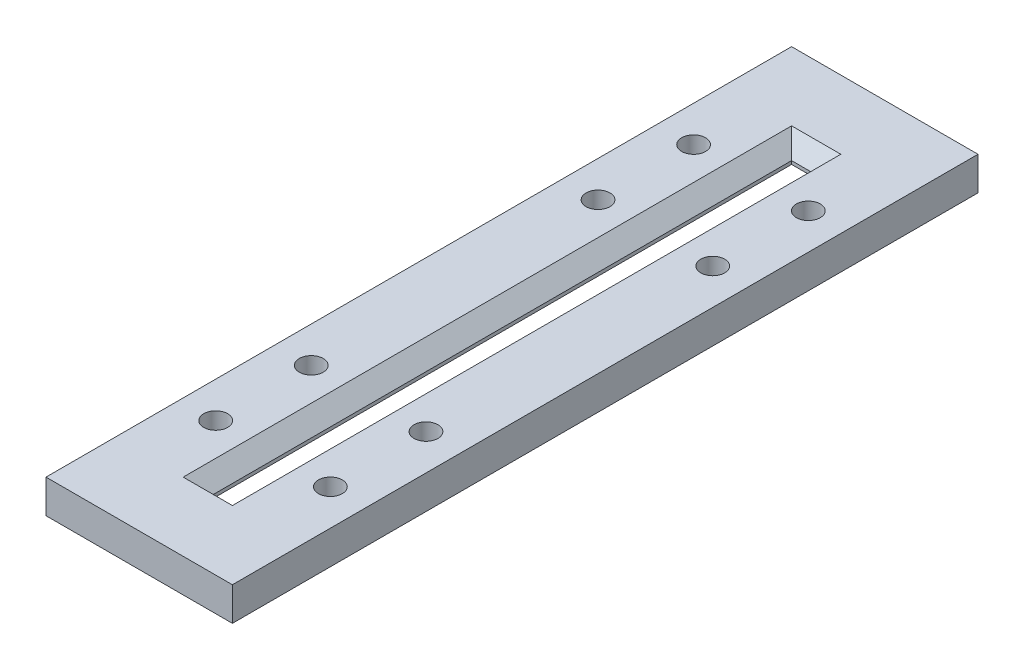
ISO-10303-21;
HEADER;
FILE_DESCRIPTION(('STEP AP214'),'2;1');
FILE_NAME('part.step','',(''),(''),'','','');
FILE_SCHEMA(('AUTOMOTIVE_DESIGN { 1 0 10303 214 1 1 1 1 }'));
ENDSEC;
DATA;
#1=APPLICATION_CONTEXT('core data for automotive mechanical design processes');
#2=APPLICATION_PROTOCOL_DEFINITION('international standard','automotive_design',2000,#1);
#3=PRODUCT_CONTEXT('',#1,'mechanical');
#4=PRODUCT('Part','Part','',(#3));
#5=PRODUCT_RELATED_PRODUCT_CATEGORY('part','',(#4));
#6=PRODUCT_DEFINITION_FORMATION('','',#4);
#7=PRODUCT_DEFINITION_CONTEXT('part definition',#1,'design');
#8=PRODUCT_DEFINITION('design','',#6,#7);
#9=PRODUCT_DEFINITION_SHAPE('','',#8);
#10=(LENGTH_UNIT() NAMED_UNIT(*) SI_UNIT(.MILLI.,.METRE.));
#11=(NAMED_UNIT(*) PLANE_ANGLE_UNIT() SI_UNIT($,.RADIAN.));
#12=(NAMED_UNIT(*) SI_UNIT($,.STERADIAN.) SOLID_ANGLE_UNIT());
#13=UNCERTAINTY_MEASURE_WITH_UNIT(LENGTH_MEASURE(1.E-05),#10,'distance_accuracy_value','');
#14=(GEOMETRIC_REPRESENTATION_CONTEXT(3) GLOBAL_UNCERTAINTY_ASSIGNED_CONTEXT((#13)) GLOBAL_UNIT_ASSIGNED_CONTEXT((#10,
#11,#12)) REPRESENTATION_CONTEXT('',''));
#15=CARTESIAN_POINT('',(0.,0.,0.));
#16=DIRECTION('',(0.,0.,1.));
#17=DIRECTION('',(1.,0.,0.));
#18=AXIS2_PLACEMENT_3D('',#15,#16,#17);
#19=CARTESIAN_POINT('',(0.,44.45,0.));
#20=DIRECTION('',(0.,1.,0.));
#21=DIRECTION('',(0.,0.,1.));
#22=AXIS2_PLACEMENT_3D('',#19,#20,#21);
#23=PLANE('',#22);
#24=DIRECTION('',(0.,0.,-1.));
#25=VECTOR('',#24,1.);
#26=CARTESIAN_POINT('',(-32.7,44.45,0.));
#27=LINE('',#26,#25);
#28=CARTESIAN_POINT('',(-32.7,44.45,404.174999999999));
#29=VERTEX_POINT('',#28);
#30=CARTESIAN_POINT('',(-32.7000000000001,44.45,-404.175000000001));
#31=VERTEX_POINT('',#30);
#32=EDGE_CURVE('E211',#29,#31,#27,.T.);
#33=ORIENTED_EDGE('',*,*,#32,.T.);
#34=DIRECTION('',(1.,0.,0.));
#35=VECTOR('',#34,1.);
#36=CARTESIAN_POINT('',(0.,44.45,-404.175000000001));
#37=LINE('',#36,#35);
#38=CARTESIAN_POINT('',(32.7,44.45,-404.175000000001));
#39=VERTEX_POINT('',#38);
#40=EDGE_CURVE('E11',#31,#39,#37,.T.);
#41=ORIENTED_EDGE('',*,*,#40,.T.);
#42=DIRECTION('',(0.,0.,1.));
#43=VECTOR('',#42,1.);
#44=CARTESIAN_POINT('',(32.7,44.45,0.));
#45=LINE('',#44,#43);
#46=CARTESIAN_POINT('',(32.7000000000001,44.45,404.174999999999));
#47=VERTEX_POINT('',#46);
#48=EDGE_CURVE('E60',#39,#47,#45,.T.);
#49=ORIENTED_EDGE('',*,*,#48,.T.);
#50=DIRECTION('',(-1.,0.,0.));
#51=VECTOR('',#50,1.);
#52=CARTESIAN_POINT('',(0.,44.45,404.174999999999));
#53=LINE('',#52,#51);
#54=EDGE_CURVE('E212',#47,#29,#53,.T.);
#55=ORIENTED_EDGE('',*,*,#54,.T.);
#56=EDGE_LOOP('',(#33,#41,#49,#55));
#57=FACE_BOUND('',#56,.T.);
#58=CARTESIAN_POINT('',(-76.1999999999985,44.45,317.499999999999));
#59=DIRECTION('',(0.,1.,0.));
#60=DIRECTION('',(0.,0.,1.));
#61=AXIS2_PLACEMENT_3D('',#58,#59,#60);
#62=CIRCLE('',#61,15.8749999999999);
#63=CARTESIAN_POINT('',(-76.1999999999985,44.45,333.374999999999));
#64=VERTEX_POINT('',#63);
#65=EDGE_CURVE('E412',#64,#64,#62,.T.);
#66=ORIENTED_EDGE('',*,*,#65,.F.);
#67=EDGE_LOOP('',(#66));
#68=FACE_BOUND('',#67,.T.);
#69=CARTESIAN_POINT('',(-76.1999999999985,44.45,-317.500000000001));
#70=DIRECTION('',(0.,1.,0.));
#71=DIRECTION('',(0.,0.,1.));
#72=AXIS2_PLACEMENT_3D('',#69,#70,#71);
#73=CIRCLE('',#72,15.875);
#74=CARTESIAN_POINT('',(-76.1999999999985,44.45,-301.625000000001));
#75=VERTEX_POINT('',#74);
#76=EDGE_CURVE('E419',#75,#75,#73,.T.);
#77=ORIENTED_EDGE('',*,*,#76,.F.);
#78=EDGE_LOOP('',(#77));
#79=FACE_BOUND('',#78,.T.);
#80=CARTESIAN_POINT('',(76.2000000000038,44.45,-317.500000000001));
#81=DIRECTION('',(0.,1.,0.));
#82=DIRECTION('',(0.,0.,1.));
#83=AXIS2_PLACEMENT_3D('',#80,#81,#82);
#84=CIRCLE('',#83,15.875);
#85=CARTESIAN_POINT('',(76.2000000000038,44.45,-301.625000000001));
#86=VERTEX_POINT('',#85);
#87=EDGE_CURVE('E428',#86,#86,#84,.T.);
#88=ORIENTED_EDGE('',*,*,#87,.F.);
#89=EDGE_LOOP('',(#88));
#90=FACE_BOUND('',#89,.T.);
#91=CARTESIAN_POINT('',(76.2000000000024,44.45,190.499999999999));
#92=DIRECTION('',(0.,1.,0.));
#93=DIRECTION('',(0.,0.,1.));
#94=AXIS2_PLACEMENT_3D('',#91,#92,#93);
#95=CIRCLE('',#94,15.875);
#96=CARTESIAN_POINT('',(76.2000000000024,44.45,206.374999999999));
#97=VERTEX_POINT('',#96);
#98=EDGE_CURVE('E382',#97,#97,#95,.T.);
#99=ORIENTED_EDGE('',*,*,#98,.F.);
#100=EDGE_LOOP('',(#99));
#101=FACE_BOUND('',#100,.T.);
#102=CARTESIAN_POINT('',(-76.1999999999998,44.45,190.499999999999));
#103=DIRECTION('',(0.,1.,0.));
#104=DIRECTION('',(0.,0.,1.));
#105=AXIS2_PLACEMENT_3D('',#102,#103,#104);
#106=CIRCLE('',#105,15.8749999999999);
#107=CARTESIAN_POINT('',(-76.1999999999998,44.45,206.374999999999));
#108=VERTEX_POINT('',#107);
#109=EDGE_CURVE('E380',#108,#108,#106,.T.);
#110=ORIENTED_EDGE('',*,*,#109,.F.);
#111=EDGE_LOOP('',(#110));
#112=FACE_BOUND('',#111,.T.);
#113=CARTESIAN_POINT('',(-76.1999999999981,44.45,-190.500000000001));
#114=DIRECTION('',(0.,1.,0.));
#115=DIRECTION('',(0.,0.,1.));
#116=AXIS2_PLACEMENT_3D('',#113,#114,#115);
#117=CIRCLE('',#116,15.875);
#118=CARTESIAN_POINT('',(-76.1999999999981,44.45,-174.625000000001));
#119=VERTEX_POINT('',#118);
#120=EDGE_CURVE('E396',#119,#119,#117,.T.);
#121=ORIENTED_EDGE('',*,*,#120,.F.);
#122=EDGE_LOOP('',(#121));
#123=FACE_BOUND('',#122,.T.);
#124=CARTESIAN_POINT('',(76.2000000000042,44.45,-190.500000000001));
#125=DIRECTION('',(0.,1.,0.));
#126=DIRECTION('',(0.,0.,1.));
#127=AXIS2_PLACEMENT_3D('',#124,#125,#126);
#128=CIRCLE('',#127,15.875);
#129=CARTESIAN_POINT('',(76.2000000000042,44.45,-174.625000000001));
#130=VERTEX_POINT('',#129);
#131=EDGE_CURVE('E234',#130,#130,#128,.T.);
#132=ORIENTED_EDGE('',*,*,#131,.F.);
#133=EDGE_LOOP('',(#132));
#134=FACE_BOUND('',#133,.T.);
#135=CARTESIAN_POINT('',(76.2000000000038,44.45,317.499999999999));
#136=DIRECTION('',(0.,1.,0.));
#137=DIRECTION('',(0.,0.,1.));
#138=AXIS2_PLACEMENT_3D('',#135,#136,#137);
#139=CIRCLE('',#138,15.875);
#140=CARTESIAN_POINT('',(76.2000000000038,44.45,333.374999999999));
#141=VERTEX_POINT('',#140);
#142=EDGE_CURVE('E279',#141,#141,#139,.T.);
#143=ORIENTED_EDGE('',*,*,#142,.F.);
#144=EDGE_LOOP('',(#143));
#145=FACE_BOUND('',#144,.T.);
#146=DIRECTION('',(1.,0.,0.));
#147=VECTOR('',#146,1.);
#148=CARTESIAN_POINT('',(-123.825,44.45,495.299999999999));
#149=LINE('',#148,#147);
#150=CARTESIAN_POINT('',(-123.825,44.45,495.299999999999));
#151=VERTEX_POINT('',#150);
#152=CARTESIAN_POINT('',(123.825,44.45,495.299999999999));
#153=VERTEX_POINT('',#152);
#154=EDGE_CURVE('E151',#151,#153,#149,.T.);
#155=ORIENTED_EDGE('',*,*,#154,.T.);
#156=DIRECTION('',(0.,0.,-1.));
#157=VECTOR('',#156,1.);
#158=CARTESIAN_POINT('',(123.825,44.45,495.299999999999));
#159=LINE('',#158,#157);
#160=CARTESIAN_POINT('',(123.825,44.45,-495.300000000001));
#161=VERTEX_POINT('',#160);
#162=EDGE_CURVE('E138',#153,#161,#159,.T.);
#163=ORIENTED_EDGE('',*,*,#162,.T.);
#164=DIRECTION('',(-1.,0.,0.));
#165=VECTOR('',#164,1.);
#166=CARTESIAN_POINT('',(123.825,44.45,-495.300000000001));
#167=LINE('',#166,#165);
#168=CARTESIAN_POINT('',(-123.825,44.45,-495.300000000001));
#169=VERTEX_POINT('',#168);
#170=EDGE_CURVE('E147',#161,#169,#167,.T.);
#171=ORIENTED_EDGE('',*,*,#170,.T.);
#172=DIRECTION('',(0.,0.,1.));
#173=VECTOR('',#172,1.);
#174=CARTESIAN_POINT('',(-123.825,44.45,-495.300000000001));
#175=LINE('',#174,#173);
#176=EDGE_CURVE('E154',#169,#151,#175,.T.);
#177=ORIENTED_EDGE('',*,*,#176,.T.);
#178=EDGE_LOOP('',(#155,#163,#171,#177));
#179=FACE_BOUND('',#178,.T.);
#180=ADVANCED_FACE('F46',(#57,#68,#79,#90,#101,#112,#123,#134,#145,#179),#23,.T.);
#181=CARTESIAN_POINT('',(0.,0.,0.));
#182=DIRECTION('',(0.,1.,0.));
#183=DIRECTION('',(0.,0.,1.));
#184=AXIS2_PLACEMENT_3D('',#181,#182,#183);
#185=PLANE('',#184);
#186=DIRECTION('',(0.,0.,1.));
#187=VECTOR('',#186,1.);
#188=CARTESIAN_POINT('',(-32.6999999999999,0.,384.174999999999));
#189=LINE('',#188,#187);
#190=CARTESIAN_POINT('',(-32.7,0.,-404.175000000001));
#191=VERTEX_POINT('',#190);
#192=CARTESIAN_POINT('',(-32.6999999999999,0.,404.174999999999));
#193=VERTEX_POINT('',#192);
#194=EDGE_CURVE('E179',#191,#193,#189,.T.);
#195=ORIENTED_EDGE('',*,*,#194,.T.);
#196=DIRECTION('',(1.,0.,0.));
#197=VECTOR('',#196,1.);
#198=CARTESIAN_POINT('',(12.7,0.,404.174999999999));
#199=LINE('',#198,#197);
#200=CARTESIAN_POINT('',(32.6999999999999,0.,404.174999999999));
#201=VERTEX_POINT('',#200);
#202=EDGE_CURVE('E182',#193,#201,#199,.T.);
#203=ORIENTED_EDGE('',*,*,#202,.T.);
#204=DIRECTION('',(0.,0.,-1.));
#205=VECTOR('',#204,1.);
#206=CARTESIAN_POINT('',(32.6999999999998,0.,-384.175000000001));
#207=LINE('',#206,#205);
#208=CARTESIAN_POINT('',(32.6999999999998,0.,-404.175000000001));
#209=VERTEX_POINT('',#208);
#210=EDGE_CURVE('E167',#201,#209,#207,.T.);
#211=ORIENTED_EDGE('',*,*,#210,.T.);
#212=DIRECTION('',(-1.,0.,0.));
#213=VECTOR('',#212,1.);
#214=CARTESIAN_POINT('',(-12.7000000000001,0.,-404.175000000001));
#215=LINE('',#214,#213);
#216=EDGE_CURVE('E168',#209,#191,#215,.T.);
#217=ORIENTED_EDGE('',*,*,#216,.T.);
#218=EDGE_LOOP('',(#195,#203,#211,#217));
#219=FACE_BOUND('',#218,.T.);
#220=CARTESIAN_POINT('',(-76.1999999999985,0.,317.499999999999));
#221=DIRECTION('',(0.,1.,0.));
#222=DIRECTION('',(0.,0.,1.));
#223=AXIS2_PLACEMENT_3D('',#220,#221,#222);
#224=CIRCLE('',#223,15.8749999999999);
#225=CARTESIAN_POINT('',(-76.1999999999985,0.,333.374999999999));
#226=VERTEX_POINT('',#225);
#227=EDGE_CURVE('E409',#226,#226,#224,.T.);
#228=ORIENTED_EDGE('',*,*,#227,.T.);
#229=EDGE_LOOP('',(#228));
#230=FACE_BOUND('',#229,.T.);
#231=CARTESIAN_POINT('',(-76.1999999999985,0.,-317.500000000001));
#232=DIRECTION('',(0.,1.,0.));
#233=DIRECTION('',(0.,0.,1.));
#234=AXIS2_PLACEMENT_3D('',#231,#232,#233);
#235=CIRCLE('',#234,15.875);
#236=CARTESIAN_POINT('',(-76.1999999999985,0.,-301.625000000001));
#237=VERTEX_POINT('',#236);
#238=EDGE_CURVE('E418',#237,#237,#235,.T.);
#239=ORIENTED_EDGE('',*,*,#238,.T.);
#240=EDGE_LOOP('',(#239));
#241=FACE_BOUND('',#240,.T.);
#242=CARTESIAN_POINT('',(76.2000000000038,0.,-317.500000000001));
#243=DIRECTION('',(0.,1.,0.));
#244=DIRECTION('',(0.,0.,1.));
#245=AXIS2_PLACEMENT_3D('',#242,#243,#244);
#246=CIRCLE('',#245,15.875);
#247=CARTESIAN_POINT('',(76.2000000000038,0.,-301.625000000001));
#248=VERTEX_POINT('',#247);
#249=EDGE_CURVE('E424',#248,#248,#246,.T.);
#250=ORIENTED_EDGE('',*,*,#249,.T.);
#251=EDGE_LOOP('',(#250));
#252=FACE_BOUND('',#251,.T.);
#253=CARTESIAN_POINT('',(76.2000000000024,0.,190.499999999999));
#254=DIRECTION('',(0.,1.,0.));
#255=DIRECTION('',(0.,0.,1.));
#256=AXIS2_PLACEMENT_3D('',#253,#254,#255);
#257=CIRCLE('',#256,15.875);
#258=CARTESIAN_POINT('',(76.2000000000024,0.,206.374999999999));
#259=VERTEX_POINT('',#258);
#260=EDGE_CURVE('E389',#259,#259,#257,.T.);
#261=ORIENTED_EDGE('',*,*,#260,.T.);
#262=EDGE_LOOP('',(#261));
#263=FACE_BOUND('',#262,.T.);
#264=CARTESIAN_POINT('',(-76.1999999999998,0.,190.499999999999));
#265=DIRECTION('',(0.,1.,0.));
#266=DIRECTION('',(0.,0.,1.));
#267=AXIS2_PLACEMENT_3D('',#264,#265,#266);
#268=CIRCLE('',#267,15.8749999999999);
#269=CARTESIAN_POINT('',(-76.1999999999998,0.,206.374999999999));
#270=VERTEX_POINT('',#269);
#271=EDGE_CURVE('E379',#270,#270,#268,.T.);
#272=ORIENTED_EDGE('',*,*,#271,.T.);
#273=EDGE_LOOP('',(#272));
#274=FACE_BOUND('',#273,.T.);
#275=CARTESIAN_POINT('',(-76.1999999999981,0.,-190.500000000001));
#276=DIRECTION('',(0.,1.,0.));
#277=DIRECTION('',(0.,0.,1.));
#278=AXIS2_PLACEMENT_3D('',#275,#276,#277);
#279=CIRCLE('',#278,15.875);
#280=CARTESIAN_POINT('',(-76.1999999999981,0.,-174.625000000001));
#281=VERTEX_POINT('',#280);
#282=EDGE_CURVE('E388',#281,#281,#279,.T.);
#283=ORIENTED_EDGE('',*,*,#282,.T.);
#284=EDGE_LOOP('',(#283));
#285=FACE_BOUND('',#284,.T.);
#286=CARTESIAN_POINT('',(76.2000000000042,0.,-190.500000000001));
#287=DIRECTION('',(0.,1.,0.));
#288=DIRECTION('',(0.,0.,1.));
#289=AXIS2_PLACEMENT_3D('',#286,#287,#288);
#290=CIRCLE('',#289,15.875);
#291=CARTESIAN_POINT('',(76.2000000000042,0.,-174.625000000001));
#292=VERTEX_POINT('',#291);
#293=EDGE_CURVE('E400',#292,#292,#290,.T.);
#294=ORIENTED_EDGE('',*,*,#293,.T.);
#295=EDGE_LOOP('',(#294));
#296=FACE_BOUND('',#295,.T.);
#297=CARTESIAN_POINT('',(76.2000000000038,0.,317.499999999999));
#298=DIRECTION('',(0.,1.,0.));
#299=DIRECTION('',(0.,0.,1.));
#300=AXIS2_PLACEMENT_3D('',#297,#298,#299);
#301=CIRCLE('',#300,15.875);
#302=CARTESIAN_POINT('',(76.2000000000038,0.,333.374999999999));
#303=VERTEX_POINT('',#302);
#304=EDGE_CURVE('E411',#303,#303,#301,.T.);
#305=ORIENTED_EDGE('',*,*,#304,.T.);
#306=EDGE_LOOP('',(#305));
#307=FACE_BOUND('',#306,.T.);
#308=DIRECTION('',(1.,0.,0.));
#309=VECTOR('',#308,1.);
#310=CARTESIAN_POINT('',(-123.825,0.,495.299999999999));
#311=LINE('',#310,#309);
#312=CARTESIAN_POINT('',(-123.825,0.,495.299999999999));
#313=VERTEX_POINT('',#312);
#314=CARTESIAN_POINT('',(123.825,0.,495.299999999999));
#315=VERTEX_POINT('',#314);
#316=EDGE_CURVE('E163',#313,#315,#311,.T.);
#317=ORIENTED_EDGE('',*,*,#316,.F.);
#318=DIRECTION('',(0.,0.,1.));
#319=VECTOR('',#318,1.);
#320=CARTESIAN_POINT('',(-123.825,0.,-495.300000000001));
#321=LINE('',#320,#319);
#322=CARTESIAN_POINT('',(-123.825,0.,-495.300000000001));
#323=VERTEX_POINT('',#322);
#324=EDGE_CURVE('E159',#323,#313,#321,.T.);
#325=ORIENTED_EDGE('',*,*,#324,.F.);
#326=DIRECTION('',(-1.,0.,0.));
#327=VECTOR('',#326,1.);
#328=CARTESIAN_POINT('',(123.825,0.,-495.300000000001));
#329=LINE('',#328,#327);
#330=CARTESIAN_POINT('',(123.825,0.,-495.300000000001));
#331=VERTEX_POINT('',#330);
#332=EDGE_CURVE('E293',#331,#323,#329,.T.);
#333=ORIENTED_EDGE('',*,*,#332,.F.);
#334=DIRECTION('',(0.,0.,-1.));
#335=VECTOR('',#334,1.);
#336=CARTESIAN_POINT('',(123.825,0.,495.299999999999));
#337=LINE('',#336,#335);
#338=EDGE_CURVE('E295',#315,#331,#337,.T.);
#339=ORIENTED_EDGE('',*,*,#338,.F.);
#340=EDGE_LOOP('',(#317,#325,#333,#339));
#341=FACE_BOUND('',#340,.T.);
#342=ADVANCED_FACE('F309',(#219,#230,#241,#252,#263,#274,#285,#296,#307,#341),#185,.F.);
#343=CARTESIAN_POINT('',(-123.825,44.45,495.299999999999));
#344=DIRECTION('',(0.,0.,-1.));
#345=DIRECTION('',(-1.,0.,0.));
#346=AXIS2_PLACEMENT_3D('',#343,#344,#345);
#347=PLANE('',#346);
#348=ORIENTED_EDGE('',*,*,#316,.T.);
#349=DIRECTION('',(0.,-1.,0.));
#350=VECTOR('',#349,1.);
#351=CARTESIAN_POINT('',(123.825,44.45,495.299999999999));
#352=LINE('',#351,#350);
#353=EDGE_CURVE('E141',#153,#315,#352,.T.);
#354=ORIENTED_EDGE('',*,*,#353,.F.);
#355=ORIENTED_EDGE('',*,*,#154,.F.);
#356=DIRECTION('',(0.,-1.,0.));
#357=VECTOR('',#356,1.);
#358=CARTESIAN_POINT('',(-123.825,44.45,495.299999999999));
#359=LINE('',#358,#357);
#360=EDGE_CURVE('E288',#151,#313,#359,.T.);
#361=ORIENTED_EDGE('',*,*,#360,.T.);
#362=EDGE_LOOP('',(#348,#354,#355,#361));
#363=FACE_BOUND('',#362,.T.);
#364=ADVANCED_FACE('F165',(#363),#347,.F.);
#365=CARTESIAN_POINT('',(123.825,44.45,495.299999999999));
#366=DIRECTION('',(-1.,0.,0.));
#367=DIRECTION('',(0.,0.,1.));
#368=AXIS2_PLACEMENT_3D('',#365,#366,#367);
#369=PLANE('',#368);
#370=ORIENTED_EDGE('',*,*,#338,.T.);
#371=DIRECTION('',(0.,-1.,0.));
#372=VECTOR('',#371,1.);
#373=CARTESIAN_POINT('',(123.825,44.45,-495.300000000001));
#374=LINE('',#373,#372);
#375=EDGE_CURVE('E148',#161,#331,#374,.T.);
#376=ORIENTED_EDGE('',*,*,#375,.F.);
#377=ORIENTED_EDGE('',*,*,#162,.F.);
#378=ORIENTED_EDGE('',*,*,#353,.T.);
#379=EDGE_LOOP('',(#370,#376,#377,#378));
#380=FACE_BOUND('',#379,.T.);
#381=ADVANCED_FACE('F143',(#380),#369,.F.);
#382=CARTESIAN_POINT('',(123.825,44.45,-495.300000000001));
#383=DIRECTION('',(0.,0.,1.));
#384=DIRECTION('',(1.,0.,0.));
#385=AXIS2_PLACEMENT_3D('',#382,#383,#384);
#386=PLANE('',#385);
#387=ORIENTED_EDGE('',*,*,#332,.T.);
#388=DIRECTION('',(0.,-1.,0.));
#389=VECTOR('',#388,1.);
#390=CARTESIAN_POINT('',(-123.825,44.45,-495.300000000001));
#391=LINE('',#390,#389);
#392=EDGE_CURVE('E174',#169,#323,#391,.T.);
#393=ORIENTED_EDGE('',*,*,#392,.F.);
#394=ORIENTED_EDGE('',*,*,#170,.F.);
#395=ORIENTED_EDGE('',*,*,#375,.T.);
#396=EDGE_LOOP('',(#387,#393,#394,#395));
#397=FACE_BOUND('',#396,.T.);
#398=ADVANCED_FACE('F313',(#397),#386,.F.);
#399=CARTESIAN_POINT('',(-123.825,44.45,-495.300000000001));
#400=DIRECTION('',(1.,0.,0.));
#401=DIRECTION('',(0.,0.,-1.));
#402=AXIS2_PLACEMENT_3D('',#399,#400,#401);
#403=PLANE('',#402);
#404=ORIENTED_EDGE('',*,*,#324,.T.);
#405=ORIENTED_EDGE('',*,*,#360,.F.);
#406=ORIENTED_EDGE('',*,*,#176,.F.);
#407=ORIENTED_EDGE('',*,*,#392,.T.);
#408=EDGE_LOOP('',(#404,#405,#406,#407));
#409=FACE_BOUND('',#408,.T.);
#410=ADVANCED_FACE('F308',(#409),#403,.F.);
#411=CARTESIAN_POINT('',(-12.7,44.45,384.174999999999));
#412=DIRECTION('',(0.,0.,-1.));
#413=DIRECTION('',(-1.,0.,0.));
#414=AXIS2_PLACEMENT_3D('',#411,#412,#413);
#415=PLANE('',#414);
#416=DIRECTION('',(0.,-1.,0.));
#417=VECTOR('',#416,1.);
#418=CARTESIAN_POINT('',(12.7,44.45,384.174999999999));
#419=LINE('',#418,#417);
#420=CARTESIAN_POINT('',(12.7,24.4500000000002,384.174999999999));
#421=VERTEX_POINT('',#420);
#422=CARTESIAN_POINT('',(12.7,20.,384.174999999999));
#423=VERTEX_POINT('',#422);
#424=EDGE_CURVE('E277',#421,#423,#419,.T.);
#425=ORIENTED_EDGE('',*,*,#424,.T.);
#426=DIRECTION('',(-1.,0.,0.));
#427=VECTOR('',#426,1.);
#428=CARTESIAN_POINT('',(-12.7,20.,384.174999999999));
#429=LINE('',#428,#427);
#430=CARTESIAN_POINT('',(-12.7,20.,384.174999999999));
#431=VERTEX_POINT('',#430);
#432=EDGE_CURVE('E187',#423,#431,#429,.T.);
#433=ORIENTED_EDGE('',*,*,#432,.T.);
#434=DIRECTION('',(0.,-1.,0.));
#435=VECTOR('',#434,1.);
#436=CARTESIAN_POINT('',(-12.7,44.45,384.174999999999));
#437=LINE('',#436,#435);
#438=CARTESIAN_POINT('',(-12.7,24.4500000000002,384.174999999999));
#439=VERTEX_POINT('',#438);
#440=EDGE_CURVE('E275',#439,#431,#437,.T.);
#441=ORIENTED_EDGE('',*,*,#440,.F.);
#442=DIRECTION('',(1.,0.,0.));
#443=VECTOR('',#442,1.);
#444=CARTESIAN_POINT('',(-12.7,24.4500000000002,384.174999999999));
#445=LINE('',#444,#443);
#446=EDGE_CURVE('E183',#439,#421,#445,.T.);
#447=ORIENTED_EDGE('',*,*,#446,.T.);
#448=EDGE_LOOP('',(#425,#433,#441,#447));
#449=FACE_BOUND('',#448,.T.);
#450=ADVANCED_FACE('F318',(#449),#415,.T.);
#451=CARTESIAN_POINT('',(12.7,44.45,384.174999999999));
#452=DIRECTION('',(-1.,0.,0.));
#453=DIRECTION('',(0.,0.,1.));
#454=AXIS2_PLACEMENT_3D('',#451,#452,#453);
#455=PLANE('',#454);
#456=DIRECTION('',(0.,-1.,0.));
#457=VECTOR('',#456,1.);
#458=CARTESIAN_POINT('',(12.6999999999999,44.45,-384.175000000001));
#459=LINE('',#458,#457);
#460=CARTESIAN_POINT('',(12.6999999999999,24.4500000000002,-384.175000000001));
#461=VERTEX_POINT('',#460);
#462=CARTESIAN_POINT('',(12.6999999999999,20.,-384.175000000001));
#463=VERTEX_POINT('',#462);
#464=EDGE_CURVE('E268',#461,#463,#459,.T.);
#465=ORIENTED_EDGE('',*,*,#464,.T.);
#466=DIRECTION('',(0.,0.,1.));
#467=VECTOR('',#466,1.);
#468=CARTESIAN_POINT('',(12.7,20.,384.174999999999));
#469=LINE('',#468,#467);
#470=EDGE_CURVE('E208',#463,#423,#469,.T.);
#471=ORIENTED_EDGE('',*,*,#470,.T.);
#472=ORIENTED_EDGE('',*,*,#424,.F.);
#473=DIRECTION('',(0.,0.,-1.));
#474=VECTOR('',#473,1.);
#475=CARTESIAN_POINT('',(12.7,24.4500000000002,384.174999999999));
#476=LINE('',#475,#474);
#477=EDGE_CURVE('E202',#421,#461,#476,.T.);
#478=ORIENTED_EDGE('',*,*,#477,.T.);
#479=EDGE_LOOP('',(#465,#471,#472,#478));
#480=FACE_BOUND('',#479,.T.);
#481=ADVANCED_FACE('F335',(#480),#455,.T.);
#482=CARTESIAN_POINT('',(12.6999999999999,44.45,-384.175000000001));
#483=DIRECTION('',(0.,0.,1.));
#484=DIRECTION('',(1.,0.,0.));
#485=AXIS2_PLACEMENT_3D('',#482,#483,#484);
#486=PLANE('',#485);
#487=DIRECTION('',(0.,-1.,0.));
#488=VECTOR('',#487,1.);
#489=CARTESIAN_POINT('',(-12.7000000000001,44.45,-384.175000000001));
#490=LINE('',#489,#488);
#491=CARTESIAN_POINT('',(-12.7000000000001,24.4500000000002,-384.175000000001));
#492=VERTEX_POINT('',#491);
#493=CARTESIAN_POINT('',(-12.7000000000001,20.,-384.175000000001));
#494=VERTEX_POINT('',#493);
#495=EDGE_CURVE('E264',#492,#494,#490,.T.);
#496=ORIENTED_EDGE('',*,*,#495,.T.);
#497=DIRECTION('',(1.,0.,0.));
#498=VECTOR('',#497,1.);
#499=CARTESIAN_POINT('',(12.6999999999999,20.,-384.175000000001));
#500=LINE('',#499,#498);
#501=EDGE_CURVE('E205',#494,#463,#500,.T.);
#502=ORIENTED_EDGE('',*,*,#501,.T.);
#503=ORIENTED_EDGE('',*,*,#464,.F.);
#504=DIRECTION('',(-1.,0.,0.));
#505=VECTOR('',#504,1.);
#506=CARTESIAN_POINT('',(12.6999999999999,24.4500000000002,-384.175000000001));
#507=LINE('',#506,#505);
#508=EDGE_CURVE('E196',#461,#492,#507,.T.);
#509=ORIENTED_EDGE('',*,*,#508,.T.);
#510=EDGE_LOOP('',(#496,#502,#503,#509));
#511=FACE_BOUND('',#510,.T.);
#512=ADVANCED_FACE('F262',(#511),#486,.T.);
#513=CARTESIAN_POINT('',(-12.7000000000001,44.45,-384.175000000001));
#514=DIRECTION('',(1.,0.,0.));
#515=DIRECTION('',(0.,0.,-1.));
#516=AXIS2_PLACEMENT_3D('',#513,#514,#515);
#517=PLANE('',#516);
#518=ORIENTED_EDGE('',*,*,#440,.T.);
#519=DIRECTION('',(0.,0.,-1.));
#520=VECTOR('',#519,1.);
#521=CARTESIAN_POINT('',(-12.7000000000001,20.,-384.175000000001));
#522=LINE('',#521,#520);
#523=EDGE_CURVE('E195',#431,#494,#522,.T.);
#524=ORIENTED_EDGE('',*,*,#523,.T.);
#525=ORIENTED_EDGE('',*,*,#495,.F.);
#526=DIRECTION('',(0.,0.,1.));
#527=VECTOR('',#526,1.);
#528=CARTESIAN_POINT('',(-12.7000000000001,24.4500000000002,-384.175000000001));
#529=LINE('',#528,#527);
#530=EDGE_CURVE('E192',#492,#439,#529,.T.);
#531=ORIENTED_EDGE('',*,*,#530,.T.);
#532=EDGE_LOOP('',(#518,#524,#525,#531));
#533=FACE_BOUND('',#532,.T.);
#534=ADVANCED_FACE('F267',(#533),#517,.T.);
#535=CARTESIAN_POINT('',(76.2000000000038,44.45,317.499999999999));
#536=DIRECTION('',(0.,-1.,0.));
#537=DIRECTION('',(0.,0.,-1.));
#538=AXIS2_PLACEMENT_3D('',#535,#536,#537);
#539=CYLINDRICAL_SURFACE('',#538,15.875);
#540=ORIENTED_EDGE('',*,*,#142,.T.);
#541=EDGE_LOOP('',(#540));
#542=FACE_BOUND('',#541,.T.);
#543=ORIENTED_EDGE('',*,*,#304,.F.);
#544=EDGE_LOOP('',(#543));
#545=FACE_BOUND('',#544,.T.);
#546=ADVANCED_FACE('F341',(#542,#545),#539,.F.);
#547=CARTESIAN_POINT('',(76.2000000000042,44.45,-190.500000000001));
#548=DIRECTION('',(0.,-1.,0.));
#549=DIRECTION('',(0.,0.,-1.));
#550=AXIS2_PLACEMENT_3D('',#547,#548,#549);
#551=CYLINDRICAL_SURFACE('',#550,15.875);
#552=ORIENTED_EDGE('',*,*,#131,.T.);
#553=EDGE_LOOP('',(#552));
#554=FACE_BOUND('',#553,.T.);
#555=ORIENTED_EDGE('',*,*,#293,.F.);
#556=EDGE_LOOP('',(#555));
#557=FACE_BOUND('',#556,.T.);
#558=ADVANCED_FACE('F343',(#554,#557),#551,.F.);
#559=CARTESIAN_POINT('',(-76.1999999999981,44.45,-190.500000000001));
#560=DIRECTION('',(0.,-1.,0.));
#561=DIRECTION('',(0.,0.,-1.));
#562=AXIS2_PLACEMENT_3D('',#559,#560,#561);
#563=CYLINDRICAL_SURFACE('',#562,15.875);
#564=ORIENTED_EDGE('',*,*,#120,.T.);
#565=EDGE_LOOP('',(#564));
#566=FACE_BOUND('',#565,.T.);
#567=ORIENTED_EDGE('',*,*,#282,.F.);
#568=EDGE_LOOP('',(#567));
#569=FACE_BOUND('',#568,.T.);
#570=ADVANCED_FACE('F364',(#566,#569),#563,.F.);
#571=CARTESIAN_POINT('',(-76.1999999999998,44.45,190.499999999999));
#572=DIRECTION('',(0.,-1.,0.));
#573=DIRECTION('',(0.,0.,-1.));
#574=AXIS2_PLACEMENT_3D('',#571,#572,#573);
#575=CYLINDRICAL_SURFACE('',#574,15.8749999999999);
#576=ORIENTED_EDGE('',*,*,#109,.T.);
#577=EDGE_LOOP('',(#576));
#578=FACE_BOUND('',#577,.T.);
#579=ORIENTED_EDGE('',*,*,#271,.F.);
#580=EDGE_LOOP('',(#579));
#581=FACE_BOUND('',#580,.T.);
#582=ADVANCED_FACE('F348',(#578,#581),#575,.F.);
#583=CARTESIAN_POINT('',(76.2000000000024,44.45,190.499999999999));
#584=DIRECTION('',(0.,-1.,0.));
#585=DIRECTION('',(0.,0.,-1.));
#586=AXIS2_PLACEMENT_3D('',#583,#584,#585);
#587=CYLINDRICAL_SURFACE('',#586,15.875);
#588=ORIENTED_EDGE('',*,*,#98,.T.);
#589=EDGE_LOOP('',(#588));
#590=FACE_BOUND('',#589,.T.);
#591=ORIENTED_EDGE('',*,*,#260,.F.);
#592=EDGE_LOOP('',(#591));
#593=FACE_BOUND('',#592,.T.);
#594=ADVANCED_FACE('F347',(#590,#593),#587,.F.);
#595=CARTESIAN_POINT('',(76.2000000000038,44.45,-317.500000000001));
#596=DIRECTION('',(0.,-1.,0.));
#597=DIRECTION('',(0.,0.,-1.));
#598=AXIS2_PLACEMENT_3D('',#595,#596,#597);
#599=CYLINDRICAL_SURFACE('',#598,15.875);
#600=ORIENTED_EDGE('',*,*,#87,.T.);
#601=EDGE_LOOP('',(#600));
#602=FACE_BOUND('',#601,.T.);
#603=ORIENTED_EDGE('',*,*,#249,.F.);
#604=EDGE_LOOP('',(#603));
#605=FACE_BOUND('',#604,.T.);
#606=ADVANCED_FACE('F349',(#602,#605),#599,.F.);
#607=CARTESIAN_POINT('',(-76.1999999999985,44.45,-317.500000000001));
#608=DIRECTION('',(0.,-1.,0.));
#609=DIRECTION('',(0.,0.,-1.));
#610=AXIS2_PLACEMENT_3D('',#607,#608,#609);
#611=CYLINDRICAL_SURFACE('',#610,15.875);
#612=ORIENTED_EDGE('',*,*,#76,.T.);
#613=EDGE_LOOP('',(#612));
#614=FACE_BOUND('',#613,.T.);
#615=ORIENTED_EDGE('',*,*,#238,.F.);
#616=EDGE_LOOP('',(#615));
#617=FACE_BOUND('',#616,.T.);
#618=ADVANCED_FACE('F355',(#614,#617),#611,.F.);
#619=CARTESIAN_POINT('',(-76.1999999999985,44.45,317.499999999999));
#620=DIRECTION('',(0.,-1.,0.));
#621=DIRECTION('',(0.,0.,-1.));
#622=AXIS2_PLACEMENT_3D('',#619,#620,#621);
#623=CYLINDRICAL_SURFACE('',#622,15.8749999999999);
#624=ORIENTED_EDGE('',*,*,#65,.T.);
#625=EDGE_LOOP('',(#624));
#626=FACE_BOUND('',#625,.T.);
#627=ORIENTED_EDGE('',*,*,#227,.F.);
#628=EDGE_LOOP('',(#627));
#629=FACE_BOUND('',#628,.T.);
#630=ADVANCED_FACE('F359',(#626,#629),#623,.F.);
#631=CARTESIAN_POINT('',(0.,0.,-404.175000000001));
#632=DIRECTION('',(0.,-0.707106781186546,0.707106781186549));
#633=DIRECTION('',(1.,0.,0.));
#634=AXIS2_PLACEMENT_3D('',#631,#632,#633);
#635=PLANE('',#634);
#636=DIRECTION('',(0.577350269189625,-0.577350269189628,-0.577350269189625));
#637=VECTOR('',#636,1.);
#638=CARTESIAN_POINT('',(21.7999999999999,10.9,-393.275000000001));
#639=LINE('',#638,#637);
#640=EDGE_CURVE('E223',#463,#209,#639,.T.);
#641=ORIENTED_EDGE('',*,*,#640,.F.);
#642=ORIENTED_EDGE('',*,*,#501,.F.);
#643=DIRECTION('',(-0.577350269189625,-0.577350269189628,-0.577350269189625));
#644=VECTOR('',#643,1.);
#645=CARTESIAN_POINT('',(102.025,134.725,-269.450000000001));
#646=LINE('',#645,#644);
#647=EDGE_CURVE('E230',#191,#494,#646,.F.);
#648=ORIENTED_EDGE('',*,*,#647,.F.);
#649=ORIENTED_EDGE('',*,*,#216,.F.);
#650=EDGE_LOOP('',(#641,#642,#648,#649));
#651=FACE_BOUND('',#650,.T.);
#652=ADVANCED_FACE('F363',(#651),#635,.T.);
#653=CARTESIAN_POINT('',(-32.6999999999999,0.,0.));
#654=DIRECTION('',(0.707106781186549,-0.707106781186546,0.));
#655=DIRECTION('',(0.,0.,-1.));
#656=AXIS2_PLACEMENT_3D('',#653,#654,#655);
#657=PLANE('',#656);
#658=ORIENTED_EDGE('',*,*,#647,.T.);
#659=ORIENTED_EDGE('',*,*,#523,.F.);
#660=DIRECTION('',(-0.577350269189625,-0.577350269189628,0.577350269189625));
#661=VECTOR('',#660,1.);
#662=CARTESIAN_POINT('',(-21.8,10.9,393.274999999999));
#663=LINE('',#662,#661);
#664=EDGE_CURVE('E225',#193,#431,#663,.F.);
#665=ORIENTED_EDGE('',*,*,#664,.F.);
#666=ORIENTED_EDGE('',*,*,#194,.F.);
#667=EDGE_LOOP('',(#658,#659,#665,#666));
#668=FACE_BOUND('',#667,.T.);
#669=ADVANCED_FACE('F506',(#668),#657,.T.);
#670=CARTESIAN_POINT('',(32.6999999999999,0.,0.));
#671=DIRECTION('',(-0.70710678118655,-0.707106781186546,0.));
#672=DIRECTION('',(0.,0.,1.));
#673=AXIS2_PLACEMENT_3D('',#670,#671,#672);
#674=PLANE('',#673);
#675=ORIENTED_EDGE('',*,*,#640,.T.);
#676=ORIENTED_EDGE('',*,*,#210,.F.);
#677=DIRECTION('',(-0.577350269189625,0.577350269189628,-0.577350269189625));
#678=VECTOR('',#677,1.);
#679=CARTESIAN_POINT('',(21.8,10.9,393.274999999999));
#680=LINE('',#679,#678);
#681=EDGE_CURVE('E218',#423,#201,#680,.F.);
#682=ORIENTED_EDGE('',*,*,#681,.F.);
#683=ORIENTED_EDGE('',*,*,#470,.F.);
#684=EDGE_LOOP('',(#675,#676,#682,#683));
#685=FACE_BOUND('',#684,.T.);
#686=ADVANCED_FACE('F518',(#685),#674,.T.);
#687=CARTESIAN_POINT('',(0.,0.,404.174999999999));
#688=DIRECTION('',(0.,-0.707106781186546,-0.707106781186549));
#689=DIRECTION('',(-1.,0.,0.));
#690=AXIS2_PLACEMENT_3D('',#687,#688,#689);
#691=PLANE('',#690);
#692=ORIENTED_EDGE('',*,*,#664,.T.);
#693=ORIENTED_EDGE('',*,*,#432,.F.);
#694=ORIENTED_EDGE('',*,*,#681,.T.);
#695=ORIENTED_EDGE('',*,*,#202,.F.);
#696=EDGE_LOOP('',(#692,#693,#694,#695));
#697=FACE_BOUND('',#696,.T.);
#698=ADVANCED_FACE('F528',(#697),#691,.T.);
#699=CARTESIAN_POINT('',(-12.7,24.4500000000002,384.174999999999));
#700=DIRECTION('',(0.,-0.707106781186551,0.707106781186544));
#701=DIRECTION('',(1.,0.,0.));
#702=AXIS2_PLACEMENT_3D('',#699,#700,#701);
#703=PLANE('',#702);
#704=DIRECTION('',(0.577350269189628,-0.577350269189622,-0.577350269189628));
#705=VECTOR('',#704,1.);
#706=CARTESIAN_POINT('',(-12.7,24.4500000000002,384.174999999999));
#707=LINE('',#706,#705);
#708=EDGE_CURVE('E236',#29,#439,#707,.T.);
#709=ORIENTED_EDGE('',*,*,#708,.F.);
#710=ORIENTED_EDGE('',*,*,#54,.F.);
#711=DIRECTION('',(-0.577350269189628,-0.577350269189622,-0.577350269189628));
#712=VECTOR('',#711,1.);
#713=CARTESIAN_POINT('',(12.7,24.4500000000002,384.174999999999));
#714=LINE('',#713,#712);
#715=EDGE_CURVE('E51',#421,#47,#714,.F.);
#716=ORIENTED_EDGE('',*,*,#715,.F.);
#717=ORIENTED_EDGE('',*,*,#446,.F.);
#718=EDGE_LOOP('',(#709,#710,#716,#717));
#719=FACE_BOUND('',#718,.T.);
#720=ADVANCED_FACE('F47',(#719),#703,.F.);
#721=CARTESIAN_POINT('',(12.7,24.4500000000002,384.174999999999));
#722=DIRECTION('',(0.707106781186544,-0.707106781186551,0.));
#723=DIRECTION('',(0.,0.,-1.));
#724=AXIS2_PLACEMENT_3D('',#721,#722,#723);
#725=PLANE('',#724);
#726=ORIENTED_EDGE('',*,*,#715,.T.);
#727=ORIENTED_EDGE('',*,*,#48,.F.);
#728=DIRECTION('',(-0.577350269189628,-0.577350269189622,0.577350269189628));
#729=VECTOR('',#728,1.);
#730=CARTESIAN_POINT('',(12.6999999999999,24.4500000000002,-384.175000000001));
#731=LINE('',#730,#729);
#732=EDGE_CURVE('E61',#461,#39,#731,.F.);
#733=ORIENTED_EDGE('',*,*,#732,.F.);
#734=ORIENTED_EDGE('',*,*,#477,.F.);
#735=EDGE_LOOP('',(#726,#727,#733,#734));
#736=FACE_BOUND('',#735,.T.);
#737=ADVANCED_FACE('F250',(#736),#725,.F.);
#738=CARTESIAN_POINT('',(-12.7000000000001,24.4500000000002,-384.175000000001));
#739=DIRECTION('',(-0.707106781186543,-0.707106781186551,0.));
#740=DIRECTION('',(0.,0.,1.));
#741=AXIS2_PLACEMENT_3D('',#738,#739,#740);
#742=PLANE('',#741);
#743=ORIENTED_EDGE('',*,*,#708,.T.);
#744=ORIENTED_EDGE('',*,*,#530,.F.);
#745=DIRECTION('',(-0.577350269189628,0.577350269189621,-0.577350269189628));
#746=VECTOR('',#745,1.);
#747=CARTESIAN_POINT('',(-4.23333333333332,15.9833333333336,-375.708333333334));
#748=LINE('',#747,#746);
#749=EDGE_CURVE('E233',#31,#492,#748,.F.);
#750=ORIENTED_EDGE('',*,*,#749,.F.);
#751=ORIENTED_EDGE('',*,*,#32,.F.);
#752=EDGE_LOOP('',(#743,#744,#750,#751));
#753=FACE_BOUND('',#752,.T.);
#754=ADVANCED_FACE('F258',(#753),#742,.F.);
#755=CARTESIAN_POINT('',(12.6999999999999,24.4500000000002,-384.175000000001));
#756=DIRECTION('',(0.,-0.707106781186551,-0.707106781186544));
#757=DIRECTION('',(-1.,0.,0.));
#758=AXIS2_PLACEMENT_3D('',#755,#756,#757);
#759=PLANE('',#758);
#760=ORIENTED_EDGE('',*,*,#732,.T.);
#761=ORIENTED_EDGE('',*,*,#40,.F.);
#762=ORIENTED_EDGE('',*,*,#749,.T.);
#763=ORIENTED_EDGE('',*,*,#508,.F.);
#764=EDGE_LOOP('',(#760,#761,#762,#763));
#765=FACE_BOUND('',#764,.T.);
#766=ADVANCED_FACE('F254',(#765),#759,.F.);
#767=CLOSED_SHELL('',(#180,#342,#364,#381,#398,#410,#450,#481,#512,#534,#546,#558,#570,#582,
#594,#606,#618,#630,#652,#669,#686,#698,#720,#737,#754,#766));
#768=MANIFOLD_SOLID_BREP('B2',#767);
#769=ADVANCED_BREP_SHAPE_REPRESENTATION('',(#18,#768),#14);
#770=SHAPE_DEFINITION_REPRESENTATION(#9,#769);
ENDSEC;
END-ISO-10303-21;
